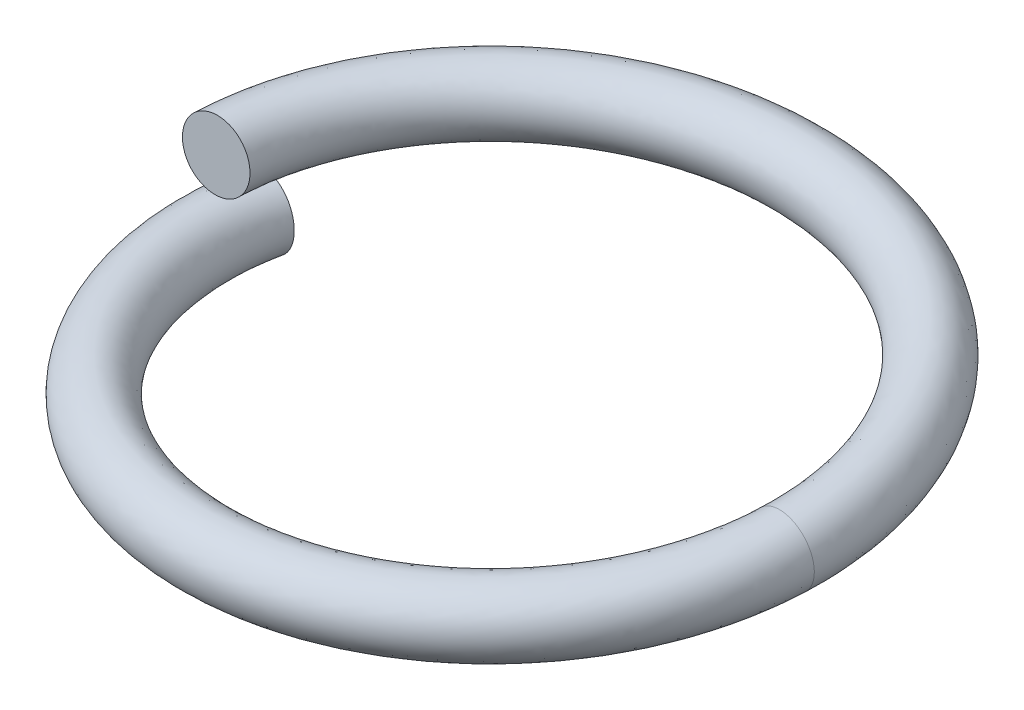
ISO-10303-21;
HEADER;
FILE_DESCRIPTION(('STEP AP214'),'2;1');
FILE_NAME('part.step','',(''),(''),'','','');
FILE_SCHEMA(('AUTOMOTIVE_DESIGN { 1 0 10303 214 1 1 1 1 }'));
ENDSEC;
DATA;
#1=APPLICATION_CONTEXT('core data for automotive mechanical design processes');
#2=APPLICATION_PROTOCOL_DEFINITION('international standard','automotive_design',2000,#1);
#3=PRODUCT_CONTEXT('',#1,'mechanical');
#4=PRODUCT('Part','Part','',(#3));
#5=PRODUCT_RELATED_PRODUCT_CATEGORY('part','',(#4));
#6=PRODUCT_DEFINITION_FORMATION('','',#4);
#7=PRODUCT_DEFINITION_CONTEXT('part definition',#1,'design');
#8=PRODUCT_DEFINITION('design','',#6,#7);
#9=PRODUCT_DEFINITION_SHAPE('','',#8);
#10=(LENGTH_UNIT() NAMED_UNIT(*) SI_UNIT(.MILLI.,.METRE.));
#11=(NAMED_UNIT(*) PLANE_ANGLE_UNIT() SI_UNIT($,.RADIAN.));
#12=(NAMED_UNIT(*) SI_UNIT($,.STERADIAN.) SOLID_ANGLE_UNIT());
#13=UNCERTAINTY_MEASURE_WITH_UNIT(LENGTH_MEASURE(1.E-05),#10,'distance_accuracy_value','');
#14=(GEOMETRIC_REPRESENTATION_CONTEXT(3) GLOBAL_UNCERTAINTY_ASSIGNED_CONTEXT((#13)) GLOBAL_UNIT_ASSIGNED_CONTEXT((#10,
#11,#12)) REPRESENTATION_CONTEXT('',''));
#15=CARTESIAN_POINT('',(0.,0.,0.));
#16=DIRECTION('',(0.,0.,1.));
#17=DIRECTION('',(1.,0.,0.));
#18=AXIS2_PLACEMENT_3D('',#15,#16,#17);
#19=CARTESIAN_POINT('',(-4.38,0.499670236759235,-0.0181563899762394));
#20=CARTESIAN_POINT('',(-4.37756391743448,0.478316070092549,-0.605830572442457));
#21=CARTESIAN_POINT('',(-4.25528345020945,0.4569619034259,-1.19275281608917));
#22=CARTESIAN_POINT('',(-3.79037558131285,0.414253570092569,-2.27225647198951));
#23=CARTESIAN_POINT('',(-3.44795000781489,0.392899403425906,-2.76436923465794));
#24=CARTESIAN_POINT('',(-2.59731909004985,0.350191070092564,-3.5754762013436));
#25=CARTESIAN_POINT('',(-2.08948302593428,0.328836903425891,-3.89411828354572));
#26=CARTESIAN_POINT('',(-0.989097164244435,0.286128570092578,-4.30717811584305));
#27=CARTESIAN_POINT('',(-0.397025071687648,0.264774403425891,-4.40141654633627));
#28=CARTESIAN_POINT('',(0.777225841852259,0.222066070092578,-4.35040417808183));
#29=CARTESIAN_POINT('',(1.35889489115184,0.200711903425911,-4.20517552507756));
#30=CARTESIAN_POINT('',(2.41931409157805,0.158003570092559,-3.69824496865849));
#31=CARTESIAN_POINT('',(2.89760388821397,0.136649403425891,-3.3367631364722));
#32=CARTESIAN_POINT('',(3.67468990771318,0.0939410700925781,-2.45494411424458));
#33=CARTESIAN_POINT('',(3.97314877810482,0.072586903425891,-1.93498974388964));
#34=CARTESIAN_POINT('',(4.34268921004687,0.0298785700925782,-0.819235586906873));
#35=CARTESIAN_POINT('',(4.41361034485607,0.00852440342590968,-0.223920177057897));
#36=CARTESIAN_POINT('',(4.3649560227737,-0.0128813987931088,0.363167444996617));
#37=CARTESIAN_POINT('',(4.36483795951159,-0.0129330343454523,0.364583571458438));
#38=CARTESIAN_POINT('',(4.36471919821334,-0.0129846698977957,0.365999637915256));
#39=CARTESIAN_POINT('',(-3.38,0.499670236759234,-0.0181563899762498));
#40=CARTESIAN_POINT('',(-3.37756391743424,0.478316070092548,-0.471658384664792));
#41=CARTESIAN_POINT('',(-3.28264542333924,0.4569619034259,-0.924466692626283));
#42=CARTESIAN_POINT('',(-2.92285743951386,0.414253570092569,-1.75707257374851));
#43=CARTESIAN_POINT('',(-2.65814414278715,0.392899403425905,-2.13650868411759));
#44=CARTESIAN_POINT('',(-2.0009502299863,0.350191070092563,-2.76162955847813));
#45=CARTESIAN_POINT('',(-1.60875491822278,0.328836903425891,-3.00704294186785));
#46=CARTESIAN_POINT('',(-0.759203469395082,0.286128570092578,-3.32475709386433));
#47=CARTESIAN_POINT('',(-0.302216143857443,0.264774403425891,-3.3969199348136));
#48=CARTESIAN_POINT('',(0.603897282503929,0.222066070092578,-3.35644271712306));
#49=CARTESIAN_POINT('',(1.0526300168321,0.20071190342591,-3.24382023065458));
#50=CARTESIAN_POINT('',(1.87046877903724,0.158003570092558,-2.85162167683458));
#51=CARTESIAN_POINT('',(2.23921976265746,0.136649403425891,-2.57221587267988));
#52=CARTESIAN_POINT('',(2.8380573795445,0.0939410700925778,-1.89098650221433));
#53=CARTESIAN_POINT('',(3.06788404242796,0.0725869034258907,-1.48945867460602));
#54=CARTESIAN_POINT('',(3.35200001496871,0.0298785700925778,-0.628088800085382));
#55=CARTESIAN_POINT('',(3.40616598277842,0.00852440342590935,-0.168620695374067));
#56=CARTESIAN_POINT('',(3.36806414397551,-0.0128813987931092,0.284384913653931));
#57=CARTESIAN_POINT('',(3.36797169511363,-0.0129330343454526,0.285477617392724));
#58=CARTESIAN_POINT('',(3.36787870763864,-0.012984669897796,0.286570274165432));
#59=CARTESIAN_POINT('',(-3.38,-0.499670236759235,0.0181563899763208));
#60=CARTESIAN_POINT('',(-3.38243608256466,-0.521024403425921,-0.435345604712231));
#61=CARTESIAN_POINT('',(-3.29238763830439,-0.542378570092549,-0.889147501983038));
#62=CARTESIAN_POINT('',(-2.94156519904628,-0.58508690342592,-1.7255705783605));
#63=CARTESIAN_POINT('',(-2.68094350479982,-0.606441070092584,-2.10782863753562));
#64=CARTESIAN_POINT('',(-2.03050326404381,-0.649149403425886,-2.73997374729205));
#65=CARTESIAN_POINT('',(-1.64096708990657,-0.670503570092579,-2.98958636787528));
#66=CARTESIAN_POINT('',(-0.794877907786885,-0.713211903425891,-3.31640901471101));
#67=CARTESIAN_POINT('',(-0.338692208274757,-0.734566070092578,-3.39347715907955));
#68=CARTESIAN_POINT('',(0.567803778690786,-0.777274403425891,-3.36273675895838));
#69=CARTESIAN_POINT('',(1.01772053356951,-0.798628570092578,-3.25494155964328));
#70=CARTESIAN_POINT('',(1.83972553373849,-0.841336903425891,-2.87155177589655));
#71=CARTESIAN_POINT('',(2.21145692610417,-0.862691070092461,-2.59612363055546));
#72=CARTESIAN_POINT('',(2.81757851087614,-0.905399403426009,-1.92136695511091));
#73=CARTESIAN_POINT('',(3.051705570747,-0.926753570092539,-1.52233135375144));
#74=CARTESIAN_POINT('',(3.34505894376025,-0.969461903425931,-0.664063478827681));
#75=CARTESIAN_POINT('',(3.40415790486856,-0.99081607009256,-0.205203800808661));
#76=CARTESIAN_POINT('',(3.37092495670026,-1.01222187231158,0.248184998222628));
#77=CARTESIAN_POINT('',(3.37084425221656,-1.01227350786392,0.2492786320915));
#78=CARTESIAN_POINT('',(3.37076300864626,-1.01232514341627,0.25037222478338));
#79=CARTESIAN_POINT('',(-4.38,-0.499670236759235,0.0181563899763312));
#80=CARTESIAN_POINT('',(-4.38243608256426,-0.521024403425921,-0.569517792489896));
#81=CARTESIAN_POINT('',(-4.26502566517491,-0.542378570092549,-1.15743362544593));
#82=CARTESIAN_POINT('',(-3.80908334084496,-0.58508690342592,-2.24075447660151));
#83=CARTESIAN_POINT('',(-3.47074936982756,-0.606441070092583,-2.73568918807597));
#84=CARTESIAN_POINT('',(-2.62687212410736,-0.649149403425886,-3.55382039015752));
#85=CARTESIAN_POINT('',(-2.12169519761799,-0.670503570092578,-3.8766617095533));
#86=CARTESIAN_POINT('',(-1.02477160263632,-0.713211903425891,-4.29883003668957));
#87=CARTESIAN_POINT('',(-0.433501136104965,-0.734566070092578,-4.3979737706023));
#88=CARTESIAN_POINT('',(0.741132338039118,-0.777274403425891,-4.35669821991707));
#89=CARTESIAN_POINT('',(1.32398540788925,-0.798628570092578,-4.21629685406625));
#90=CARTESIAN_POINT('',(2.38857084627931,-0.841336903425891,-3.71817506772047));
#91=CARTESIAN_POINT('',(2.8698410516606,-0.86269107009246,-3.36067089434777));
#92=CARTESIAN_POINT('',(3.65421103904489,-0.905399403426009,-2.48532456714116));
#93=CARTESIAN_POINT('',(3.95697030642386,-0.926753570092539,-1.96786242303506));
#94=CARTESIAN_POINT('',(4.33574813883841,-0.96946190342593,-0.855210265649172));
#95=CARTESIAN_POINT('',(4.41160226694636,-0.99081607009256,-0.260503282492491));
#96=CARTESIAN_POINT('',(4.36781683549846,-1.01222187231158,0.326967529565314));
#97=CARTESIAN_POINT('',(4.36771051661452,-1.01227350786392,0.328384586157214));
#98=CARTESIAN_POINT('',(4.36760349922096,-1.01232514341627,0.329801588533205));
#99=CARTESIAN_POINT('',(-5.38,-0.499670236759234,0.0181563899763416));
#100=CARTESIAN_POINT('',(-5.38243608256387,-0.52102440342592,-0.703689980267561));
#101=CARTESIAN_POINT('',(-5.23766369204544,-0.542378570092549,-1.42571974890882));
#102=CARTESIAN_POINT('',(-4.67660148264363,-0.58508690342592,-2.75593837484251));
#103=CARTESIAN_POINT('',(-4.2605552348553,-0.606441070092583,-3.36354973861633));
#104=CARTESIAN_POINT('',(-3.2232409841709,-0.649149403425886,-4.36766703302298));
#105=CARTESIAN_POINT('',(-2.6024233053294,-0.670503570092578,-4.76373705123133));
#106=CARTESIAN_POINT('',(-1.25466529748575,-0.713211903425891,-5.28125105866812));
#107=CARTESIAN_POINT('',(-0.528310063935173,-0.734566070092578,-5.40247038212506));
#108=CARTESIAN_POINT('',(0.91446089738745,-0.777274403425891,-5.35065968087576));
#109=CARTESIAN_POINT('',(1.63025028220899,-0.798628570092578,-5.17765214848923));
#110=CARTESIAN_POINT('',(2.93741615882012,-0.841336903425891,-4.56479835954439));
#111=CARTESIAN_POINT('',(3.52822517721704,-0.86269107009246,-4.12521815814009));
#112=CARTESIAN_POINT('',(4.49084356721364,-0.905399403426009,-3.04928217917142));
#113=CARTESIAN_POINT('',(4.86223504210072,-0.926753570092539,-2.41339349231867));
#114=CARTESIAN_POINT('',(5.32643733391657,-0.96946190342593,-1.04635705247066));
#115=CARTESIAN_POINT('',(5.41904662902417,-0.990816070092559,-0.315802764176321));
#116=CARTESIAN_POINT('',(5.36470871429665,-1.01222187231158,0.405750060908));
#117=CARTESIAN_POINT('',(5.36457678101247,-1.01227350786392,0.407490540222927));
#118=CARTESIAN_POINT('',(5.36444398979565,-1.01232514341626,0.409230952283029));
#119=CARTESIAN_POINT('',(-5.38,0.499670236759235,-0.0181563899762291));
#120=CARTESIAN_POINT('',(-5.37756391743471,0.478316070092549,-0.740002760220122));
#121=CARTESIAN_POINT('',(-5.22792147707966,0.456961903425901,-1.46103893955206));
#122=CARTESIAN_POINT('',(-4.65789372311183,0.414253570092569,-2.78744037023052));
#123=CARTESIAN_POINT('',(-4.23775587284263,0.392899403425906,-3.3922297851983));
#124=CARTESIAN_POINT('',(-3.19368795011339,0.350191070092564,-4.38932284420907));
#125=CARTESIAN_POINT('',(-2.57021113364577,0.328836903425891,-4.78119362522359));
#126=CARTESIAN_POINT('',(-1.21899085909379,0.286128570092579,-5.28959913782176));
#127=CARTESIAN_POINT('',(-0.491833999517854,0.264774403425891,-5.40591315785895));
#128=CARTESIAN_POINT('',(0.950554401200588,0.222066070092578,-5.3443656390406));
#129=CARTESIAN_POINT('',(1.66515976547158,0.200711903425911,-5.16653081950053));
#130=CARTESIAN_POINT('',(2.96815940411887,0.158003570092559,-4.54486826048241));
#131=CARTESIAN_POINT('',(3.55598801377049,0.136649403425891,-4.10131040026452));
#132=CARTESIAN_POINT('',(4.51132243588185,0.0939410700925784,-3.01890172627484));
#133=CARTESIAN_POINT('',(4.87841351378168,0.0725869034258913,-2.38052081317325));
#134=CARTESIAN_POINT('',(5.33337840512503,0.0298785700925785,-1.01038237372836));
#135=CARTESIAN_POINT('',(5.42105470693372,0.00852440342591,-0.279219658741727));
#136=CARTESIAN_POINT('',(5.3618479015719,-0.0128813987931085,0.441949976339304));
#137=CARTESIAN_POINT('',(5.36170422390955,-0.012933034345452,0.443689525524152));
#138=CARTESIAN_POINT('',(5.36155968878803,-0.0129846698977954,0.445429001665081));
#139=CARTESIAN_POINT('',(-4.38,0.499670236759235,-0.0181563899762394));
#140=CARTESIAN_POINT('',(-4.37756391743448,0.478316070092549,-0.605830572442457));
#141=CARTESIAN_POINT('',(-4.25528345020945,0.4569619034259,-1.19275281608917));
#142=CARTESIAN_POINT('',(-3.79037558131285,0.414253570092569,-2.27225647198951));
#143=CARTESIAN_POINT('',(-3.44795000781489,0.392899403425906,-2.76436923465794));
#144=CARTESIAN_POINT('',(-2.59731909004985,0.350191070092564,-3.5754762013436));
#145=CARTESIAN_POINT('',(-2.08948302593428,0.328836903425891,-3.89411828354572));
#146=CARTESIAN_POINT('',(-0.989097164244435,0.286128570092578,-4.30717811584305));
#147=CARTESIAN_POINT('',(-0.397025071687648,0.264774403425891,-4.40141654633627));
#148=CARTESIAN_POINT('',(0.777225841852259,0.222066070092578,-4.35040417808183));
#149=CARTESIAN_POINT('',(1.35889489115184,0.200711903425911,-4.20517552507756));
#150=CARTESIAN_POINT('',(2.41931409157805,0.158003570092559,-3.69824496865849));
#151=CARTESIAN_POINT('',(2.89760388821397,0.136649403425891,-3.3367631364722));
#152=CARTESIAN_POINT('',(3.67468990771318,0.0939410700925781,-2.45494411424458));
#153=CARTESIAN_POINT('',(3.97314877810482,0.072586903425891,-1.93498974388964));
#154=CARTESIAN_POINT('',(4.34268921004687,0.0298785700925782,-0.819235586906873));
#155=CARTESIAN_POINT('',(4.41361034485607,0.00852440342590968,-0.223920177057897));
#156=CARTESIAN_POINT('',(4.3649560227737,-0.0128813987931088,0.363167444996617));
#157=CARTESIAN_POINT('',(4.36483795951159,-0.0129330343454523,0.364583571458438));
#158=CARTESIAN_POINT('',(4.36471919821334,-0.0129846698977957,0.365999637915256));
#159=(BOUNDED_SURFACE() B_SPLINE_SURFACE(3,3,((#19,#20,#21,#22,#23,#24,#25,#26,#27,#28,#29,#30,
#31,#32,#33,#34,#35,#36,#37,#38),(#39,#40,#41,#42,#43,#44,#45,#46,#47,#48,#49,#50,#51,#52,#53,
#54,#55,#56,#57,#58),(#59,#60,#61,#62,#63,#64,#65,#66,#67,#68,#69,#70,#71,#72,#73,#74,#75,#76,
#77,#78),(#79,#80,#81,#82,#83,#84,#85,#86,#87,#88,#89,#90,#91,#92,#93,#94,#95,#96,#97,#98),(#99,
#100,#101,#102,#103,#104,#105,#106,#107,#108,#109,#110,#111,#112,#113,#114,#115,#116,#117,#118),
(#119,#120,#121,#122,#123,#124,#125,#126,#127,#128,#129,#130,#131,#132,#133,#134,#135,#136,#137,
#138),(#139,#140,#141,#142,#143,#144,#145,#146,#147,#148,#149,#150,#151,#152,#153,#154,#155,
#156,#157,#158)),.UNSPECIFIED.,.T.,.F.,.F.) B_SPLINE_SURFACE_WITH_KNOTS((4,3,4),(4,2,2,2,2,2,2,
2,2,4),(0.,0.5,1.),(0.,0.0625,0.125,0.1875,0.25,0.3125,0.375,0.4375,0.5,0.500151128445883),
.UNSPECIFIED.) GEOMETRIC_REPRESENTATION_ITEM() RATIONAL_B_SPLINE_SURFACE(((1.,1.,1.,1.,1.,1.,1.,
1.,1.,1.,1.,1.,1.,1.,1.,1.,1.,1.,1.,1.),(0.333333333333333,0.333333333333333,0.333333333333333,
0.333333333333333,0.333333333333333,0.333333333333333,0.333333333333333,0.333333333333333,
0.333333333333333,0.333333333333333,0.333333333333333,0.333333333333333,0.333333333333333,
0.333333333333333,0.333333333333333,0.333333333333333,0.333333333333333,0.333333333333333,
0.333333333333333,0.333333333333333),(0.333333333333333,0.333333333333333,0.333333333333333,
0.333333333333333,0.333333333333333,0.333333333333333,0.333333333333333,0.333333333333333,
0.333333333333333,0.333333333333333,0.333333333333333,0.333333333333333,0.333333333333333,
0.333333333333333,0.333333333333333,0.333333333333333,0.333333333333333,0.333333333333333,
0.333333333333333,0.333333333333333),(1.,1.,1.,1.,1.,1.,1.,1.,1.,1.,1.,1.,1.,1.,1.,1.,1.,1.,1.,
1.),(0.333333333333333,0.333333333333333,0.333333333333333,0.333333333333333,0.333333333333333,
0.333333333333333,0.333333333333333,0.333333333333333,0.333333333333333,0.333333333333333,
0.333333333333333,0.333333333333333,0.333333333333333,0.333333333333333,0.333333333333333,
0.333333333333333,0.333333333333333,0.333333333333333,0.333333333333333,0.333333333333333),
(0.333333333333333,0.333333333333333,0.333333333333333,0.333333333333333,0.333333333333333,
0.333333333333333,0.333333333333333,0.333333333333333,0.333333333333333,0.333333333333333,
0.333333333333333,0.333333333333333,0.333333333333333,0.333333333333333,0.333333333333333,
0.333333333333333,0.333333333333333,0.333333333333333,0.333333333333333,0.333333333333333),(1.,
1.,1.,1.,1.,1.,1.,1.,1.,1.,1.,1.,1.,1.,1.,1.,1.,1.,1.,1.))) REPRESENTATION_ITEM('') SURFACE());
#160=CARTESIAN_POINT('',(-4.38,0.,0.));
#161=DIRECTION('',(0.,-0.0363127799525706,-0.999340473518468));
#162=DIRECTION('',(0.,0.999340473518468,-0.0363127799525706));
#163=AXIS2_PLACEMENT_3D('',#160,#161,#162);
#164=CIRCLE('',#163,0.5);
#165=CARTESIAN_POINT('',(-4.38,0.499670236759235,-0.0181563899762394));
#166=VERTEX_POINT('',#165);
#167=EDGE_CURVE('E48',#166,#166,#164,.T.);
#168=CARTESIAN_POINT('',(4.36616134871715,-0.51265490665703,0.34790061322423));
#169=DIRECTION('',(-0.0793769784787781,-0.0363127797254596,0.99618305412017));
#170=DIRECTION('',(-0.00288430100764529,0.999340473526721,0.0361980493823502));
#171=AXIS2_PLACEMENT_3D('',#168,#169,#170);
#172=CIRCLE('',#171,0.499999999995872);
#173=CARTESIAN_POINT('',(4.36471919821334,-0.0129846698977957,0.365999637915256));
#174=VERTEX_POINT('',#173);
#175=EDGE_CURVE('E11',#174,#174,#172,.T.);
#176=CARTESIAN_POINT('',(-4.38,0.499670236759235,-0.0181563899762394));
#177=CARTESIAN_POINT('',(-4.37939084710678,0.494329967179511,-0.165121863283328));
#178=CARTESIAN_POINT('',(-4.3712866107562,0.488989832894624,-0.312037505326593));
#179=CARTESIAN_POINT('',(-4.34039141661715,0.478309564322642,-0.604322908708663));
#180=CARTESIAN_POINT('',(-4.31760006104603,0.472969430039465,-0.749692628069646));
#181=CARTESIAN_POINT('',(-4.25763414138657,0.462289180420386,-1.03743184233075));
#182=CARTESIAN_POINT('',(-4.22045957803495,0.456949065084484,-1.17980133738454));
#183=CARTESIAN_POINT('',(-4.13202382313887,0.446268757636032,-1.46010036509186));
#184=CARTESIAN_POINT('',(-4.08076301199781,0.44092856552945,-1.59803001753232));
#185=CARTESIAN_POINT('',(-3.96447439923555,0.430248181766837,-1.86795809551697));
#186=CARTESIAN_POINT('',(-3.89944659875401,0.424907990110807,-1.99995652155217));
#187=CARTESIAN_POINT('',(-3.75648867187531,0.414227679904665,-2.25676711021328));
#188=CARTESIAN_POINT('',(-3.67855819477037,0.408887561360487,-2.38157907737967));
#189=CARTESIAN_POINT('',(-3.51063881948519,0.398207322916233,-2.62280917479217));
#190=CARTESIAN_POINT('',(-3.42064992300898,0.392867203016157,-2.73922730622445));
#191=CARTESIAN_POINT('',(-3.22945185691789,0.382186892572,-2.96245803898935));
#192=CARTESIAN_POINT('',(-3.12824298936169,0.376846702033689,-3.06927089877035));
#193=CARTESIAN_POINT('',(-2.91548329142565,0.366166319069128,-3.27204530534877));
#194=CARTESIAN_POINT('',(-2.80393246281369,0.36082612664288,-3.36800685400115));
#195=CARTESIAN_POINT('',(-2.57177636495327,0.350145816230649,-3.54826280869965));
#196=CARTESIAN_POINT('',(-2.4511708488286,0.344805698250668,-3.63255689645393));
#197=CARTESIAN_POINT('',(-2.20215478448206,0.334125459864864,-3.78869744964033));
#198=CARTESIAN_POINT('',(-2.07374423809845,0.32878533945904,-3.86054391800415));
#199=CARTESIAN_POINT('',(-1.81036391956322,0.318105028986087,-3.99100260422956));
#200=CARTESIAN_POINT('',(-1.67539432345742,0.312764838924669,-4.04961517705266));
#201=CARTESIAN_POINT('',(-1.40019230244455,0.302084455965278,-4.1528043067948));
#202=CARTESIAN_POINT('',(-1.25995987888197,0.296744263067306,-4.19738086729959));
#203=CARTESIAN_POINT('',(-0.975736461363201,0.286063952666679,-4.27225217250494));
#204=CARTESIAN_POINT('',(-0.831745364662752,0.280723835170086,-4.30254652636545));
#205=CARTESIAN_POINT('',(-0.541459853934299,0.270043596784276,-4.34862466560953));
#206=CARTESIAN_POINT('',(-0.395165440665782,0.26470347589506,-4.36440845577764));
#207=CARTESIAN_POINT('',(-0.101727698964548,0.25402316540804,-4.38122963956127));
#208=CARTESIAN_POINT('',(0.045415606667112,0.24868297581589,-4.38226742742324));
#209=CARTESIAN_POINT('',(0.339044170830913,0.238002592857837,-4.36936722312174));
#210=CARTESIAN_POINT('',(0.485529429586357,0.232662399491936,-4.35542923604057));
#211=CARTESIAN_POINT('',(0.776361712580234,0.221982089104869,-4.31294103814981));
#212=CARTESIAN_POINT('',(0.920708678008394,0.216641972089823,-4.28439042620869));
#213=CARTESIAN_POINT('',(1.20583582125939,0.205961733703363,-4.21303648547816));
#214=CARTESIAN_POINT('',(1.34661600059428,0.200621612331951,-4.17023316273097));
#215=CARTESIAN_POINT('',(1.6231789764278,0.189941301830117,-4.07072647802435));
#216=CARTESIAN_POINT('',(1.75896190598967,0.184601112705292,-4.01402348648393));
#217=CARTESIAN_POINT('',(2.02405409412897,0.173920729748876,-3.88709720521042));
#218=CARTESIAN_POINT('',(2.15336335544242,0.168580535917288,-3.81687392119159));
#219=CARTESIAN_POINT('',(2.40428903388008,0.157900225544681,-3.66382174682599));
#220=CARTESIAN_POINT('',(2.52590523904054,0.152560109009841,-3.58099250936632));
#221=CARTESIAN_POINT('',(2.76027122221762,0.141879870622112,-3.40361872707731));
#222=CARTESIAN_POINT('',(2.87302100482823,0.136539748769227,-3.30907418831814));
#223=CARTESIAN_POINT('',(3.08847596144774,0.125859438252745,-3.10915465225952));
#224=CARTESIAN_POINT('',(3.1911814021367,0.120519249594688,-3.00377994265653));
#225=CARTESIAN_POINT('',(3.38533839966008,0.109838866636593,-2.78312815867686));
#226=CARTESIAN_POINT('',(3.47678996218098,0.104498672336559,-2.66785108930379));
#227=CARTESIAN_POINT('',(3.6476761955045,0.0938183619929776,-2.4287139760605));
#228=CARTESIAN_POINT('',(3.72711053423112,0.0884782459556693,-2.30485369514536));
#229=CARTESIAN_POINT('',(3.87323122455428,0.0777980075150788,-2.04982895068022));
#230=CARTESIAN_POINT('',(3.93991758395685,0.0724578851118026,-1.9186644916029));
#231=CARTESIAN_POINT('',(4.0598048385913,0.0617775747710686,-1.65030709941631));
#232=CARTESIAN_POINT('',(4.11300609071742,0.0564373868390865,-1.51311432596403));
#233=CARTESIAN_POINT('',(4.20517443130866,0.0457570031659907,-1.23402795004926));
#234=CARTESIAN_POINT('',(4.2441415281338,0.0404168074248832,-1.09213435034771));
#235=CARTESIAN_POINT('',(4.30765698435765,0.0297364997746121,-0.80516009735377));
#236=CARTESIAN_POINT('',(4.33220494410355,0.024396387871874,-0.660079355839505));
#237=CARTESIAN_POINT('',(4.36670977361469,0.0137161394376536,-0.368190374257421));
#238=CARTESIAN_POINT('',(4.37666665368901,0.00837600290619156,-0.22138213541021));
#239=CARTESIAN_POINT('',(4.38181247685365,-0.00230427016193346,0.0724865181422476));
#240=CARTESIAN_POINT('',(4.37700180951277,-0.00764440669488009,0.219546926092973));
#241=CARTESIAN_POINT('',(4.36471919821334,-0.0129846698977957,0.365999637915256));
#242=B_SPLINE_CURVE_WITH_KNOTS('',3,(#176,#177,#178,#179,#180,#181,#182,#183,#184,#185,#186,
#187,#188,#189,#190,#191,#192,#193,#194,#195,#196,#197,#198,#199,#200,#201,#202,#203,#204,#205,
#206,#207,#208,#209,#210,#211,#212,#213,#214,#215,#216,#217,#218,#219,#220,#221,#222,#223,#224,
#225,#226,#227,#228,#229,#230,#231,#232,#233,#234,#235,#236,#237,#238,#239,#240,#241),
.UNSPECIFIED.,.F.,.F.,(4,2,2,2,2,2,2,2,2,2,2,2,2,2,2,2,2,2,2,2,2,2,2,2,2,2,2,2,2,2,2,2,4),(0.,
0.440975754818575,0.88196345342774,1.3229511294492,1.76392689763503,2.2049026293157,
2.64589034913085,3.08687800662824,3.5278537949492,3.9688295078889,4.40981724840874,
4.85080488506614,5.29178069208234,5.73275638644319,6.17374414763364,6.61473176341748,
7.05570758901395,7.49668326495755,7.9376710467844,8.37865864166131,8.81963448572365,
9.26061014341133,9.70159794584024,10.142585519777,10.5835613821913,11.024537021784,
11.4655248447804,11.9065123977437,12.3474882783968,12.7884639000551,13.2294517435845,
13.6704392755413,14.1114151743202),.UNSPECIFIED.);
#243=EDGE_CURVE('BSEAM36',#166,#174,#242,.T.);
#244=ORIENTED_EDGE('',*,*,#167,.T.);
#245=ORIENTED_EDGE('',*,*,#175,.F.);
#246=ORIENTED_EDGE('',*,*,#243,.T.);
#247=ORIENTED_EDGE('',*,*,#243,.F.);
#248=EDGE_LOOP('',(#244,#246,#245,#247));
#249=FACE_BOUND('',#248,.T.);
#250=ADVANCED_FACE('F36',(#249),#159,.T.);
#251=CARTESIAN_POINT('',(-4.38,0.,0.));
#252=DIRECTION('',(0.,-0.0363127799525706,-0.999340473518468));
#253=DIRECTION('',(0.,0.999340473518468,-0.0363127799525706));
#254=AXIS2_PLACEMENT_3D('',#251,#252,#253);
#255=PLANE('',#254);
#256=ORIENTED_EDGE('',*,*,#167,.F.);
#257=EDGE_LOOP('',(#256));
#258=FACE_BOUND('',#257,.T.);
#259=ADVANCED_FACE('F57',(#258),#255,.F.);
#260=CARTESIAN_POINT('',(-4.3260749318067,-1.025,-0.68518295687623));
#261=DIRECTION('',(0.156331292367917,-0.0363127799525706,-0.987036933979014));
#262=DIRECTION('',(0.00568057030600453,0.999340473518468,-0.0358657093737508));
#263=AXIS2_PLACEMENT_3D('',#260,#261,#262);
#264=PLANE('',#263);
#265=CARTESIAN_POINT('',(-4.3260749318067,-1.025,-0.68518295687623));
#266=DIRECTION('',(0.156331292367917,-0.0363127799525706,-0.987036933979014));
#267=DIRECTION('',(0.00568057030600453,0.999340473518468,-0.0358657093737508));
#268=AXIS2_PLACEMENT_3D('',#265,#266,#267);
#269=CIRCLE('',#268,0.5);
#270=CARTESIAN_POINT('',(-4.3232346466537,-0.525329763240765,-0.703115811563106));
#271=VERTEX_POINT('',#270);
#272=EDGE_CURVE('E44',#271,#271,#269,.T.);
#273=ORIENTED_EDGE('',*,*,#272,.T.);
#274=EDGE_LOOP('',(#273));
#275=FACE_BOUND('',#274,.T.);
#276=ADVANCED_FACE('F59',(#275),#264,.T.);
#277=CARTESIAN_POINT('',(4.36471919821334,-0.0129846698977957,0.365999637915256));
#278=CARTESIAN_POINT('',(4.31572357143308,-0.0342872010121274,0.950205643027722));
#279=CARTESIAN_POINT('',(4.14792076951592,-0.0555897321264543,1.52419867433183));
#280=CARTESIAN_POINT('',(3.60041193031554,-0.0982464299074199,2.56264130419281));
#281=CARTESIAN_POINT('',(3.22043121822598,-0.119600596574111,3.02637064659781));
#282=CARTESIAN_POINT('',(2.30878379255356,-0.16230892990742,3.76823750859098));
#283=CARTESIAN_POINT('',(1.77751284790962,-0.183663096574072,4.04605296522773));
#284=CARTESIAN_POINT('',(0.648110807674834,-0.226371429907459,4.37150419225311));
#285=CARTESIAN_POINT('',(0.0504700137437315,-0.247725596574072,4.41899867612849));
#286=CARTESIAN_POINT('',(-1.11615869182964,-0.290433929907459,4.27601289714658));
#287=CARTESIAN_POINT('',(-1.68464014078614,-0.311788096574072,4.08559470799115));
#288=CARTESIAN_POINT('',(-2.702017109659,-0.354496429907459,3.49702731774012));
#289=CARTESIAN_POINT('',(-3.15047096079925,-0.375850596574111,3.09913362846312));
#290=CARTESIAN_POINT('',(-3.85597476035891,-0.41855892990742,2.15906349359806));
#291=CARTESIAN_POINT('',(-4.11271843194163,-0.439913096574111,1.61729515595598));
#292=CARTESIAN_POINT('',(-4.39357863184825,-0.48262142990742,0.475986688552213));
#293=CARTESIAN_POINT('',(-4.41757323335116,-0.503975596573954,-0.123057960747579));
#294=CARTESIAN_POINT('',(-4.3232346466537,-0.525329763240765,-0.703115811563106));
#295=CARTESIAN_POINT('',(3.36787870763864,-0.012984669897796,0.286570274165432));
#296=CARTESIAN_POINT('',(3.32951621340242,-0.0342872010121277,0.737351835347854));
#297=CARTESIAN_POINT('',(3.1994806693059,-0.0555897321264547,1.18013967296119));
#298=CARTESIAN_POINT('',(2.77598892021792,-0.0982464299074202,1.98098085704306));
#299=CARTESIAN_POINT('',(2.48232143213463,-0.119600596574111,2.33847812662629));
#300=CARTESIAN_POINT('',(1.77810701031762,-0.16230892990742,2.91010912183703));
#301=CARTESIAN_POINT('',(1.36786579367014,-0.183663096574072,3.12399468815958));
#302=CARTESIAN_POINT('',(0.49600566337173,-0.226371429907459,3.37407439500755));
#303=CARTESIAN_POINT('',(0.0347652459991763,-0.247725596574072,3.41015996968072));
#304=CARTESIAN_POINT('',(-0.865379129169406,-0.29043392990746,3.2987146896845));
#305=CARTESIAN_POINT('',(-1.30389231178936,-0.311788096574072,3.15123221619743));
#306=CARTESIAN_POINT('',(-2.08843840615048,-0.35449642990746,2.69607578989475));
#307=CARTESIAN_POINT('',(-2.4341307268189,-0.375850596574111,2.38859943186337));
#308=CARTESIAN_POINT('',(-2.97767368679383,-0.41855892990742,1.66248580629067));
#309=CARTESIAN_POINT('',(-3.17528836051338,-0.439913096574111,1.24416376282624));
#310=CARTESIAN_POINT('',(-3.3909461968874,-0.48262142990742,0.363157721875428));
#311=CARTESIAN_POINT('',(-3.40889573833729,-0.503975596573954,-0.0991438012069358));
#312=CARTESIAN_POINT('',(-3.33554630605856,-0.525329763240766,-0.54668134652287));
#313=CARTESIAN_POINT('',(3.37076300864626,-1.01232514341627,0.25037222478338));
#314=CARTESIAN_POINT('',(3.33724552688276,-1.0336276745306,0.701539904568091));
#315=CARTESIAN_POINT('',(3.21197440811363,-1.054930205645,1.14569917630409));
#316=CARTESIAN_POINT('',(2.79711062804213,-1.09758690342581,1.95104376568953));
#317=CARTESIAN_POINT('',(2.50730072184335,-1.11894107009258,2.31167530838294));
#318=CARTESIAN_POINT('',(1.8092680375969,-1.16164940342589,2.89083877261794));
#319=CARTESIAN_POINT('',(1.40134829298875,-1.18300357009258,3.1091192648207));
#320=CARTESIAN_POINT('',(0.532225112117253,-1.22571190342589,3.36855103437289));
#321=CARTESIAN_POINT('',(0.0713989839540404,-1.2470660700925,3.40958968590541));
#322=CARTESIAN_POINT('',(-0.829890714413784,-1.28977440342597,3.30782119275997));
#323=CARTESIAN_POINT('',(-1.26996301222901,-1.3111285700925,3.16505822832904));
#324=CARTESIAN_POINT('',(-2.05935362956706,-1.35383690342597,2.718356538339));
#325=CARTESIAN_POINT('',(-2.4083292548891,-1.37519107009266,2.41461173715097));
#326=CARTESIAN_POINT('',(-2.95964157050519,-1.41789940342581,1.69437935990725));
#327=CARTESIAN_POINT('',(-3.16173892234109,-1.43925357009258,1.27820445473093));
#328=CARTESIAN_POINT('',(-3.38684906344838,-1.48196190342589,0.399566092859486));
#329=CARTESIAN_POINT('',(-3.40976412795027,-1.50331607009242,-0.0625159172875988));
#330=CARTESIAN_POINT('',(-3.34122687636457,-1.52467023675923,-0.510815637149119));
#331=CARTESIAN_POINT('',(4.36760349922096,-1.01232514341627,0.329801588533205));
#332=CARTESIAN_POINT('',(4.32345288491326,-1.0336276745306,0.91439371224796));
#333=CARTESIAN_POINT('',(4.16041450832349,-1.054930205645,1.48975817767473));
#334=CARTESIAN_POINT('',(3.62153363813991,-1.09758690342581,2.53270421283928));
#335=CARTESIAN_POINT('',(3.2454105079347,-1.11894107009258,2.99956782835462));
#336=CARTESIAN_POINT('',(2.33994481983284,-1.16164940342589,3.74896715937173));
#337=CARTESIAN_POINT('',(1.81099534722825,-1.18300357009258,4.03117754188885));
#338=CARTESIAN_POINT('',(0.684330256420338,-1.22571190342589,4.36598083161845));
#339=CARTESIAN_POINT('',(0.0871037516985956,-1.2470660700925,4.41842839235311));
#340=CARTESIAN_POINT('',(-1.08067027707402,-1.28977440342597,4.28511940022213));
#341=CARTESIAN_POINT('',(-1.65071084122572,-1.3111285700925,4.09942072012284));
#342=CARTESIAN_POINT('',(-2.67293233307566,-1.35383690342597,3.51930806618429));
#343=CARTESIAN_POINT('',(-3.12466948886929,-1.37519107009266,3.12514593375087));
#344=CARTESIAN_POINT('',(-3.83794264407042,-1.41789940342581,2.19095704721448));
#345=CARTESIAN_POINT('',(-4.09916899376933,-1.43925357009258,1.65133584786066));
#346=CARTESIAN_POINT('',(-4.38948149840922,-1.48196190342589,0.512395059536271));
#347=CARTESIAN_POINT('',(-4.41844162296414,-1.50331607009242,-0.086430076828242));
#348=CARTESIAN_POINT('',(-4.3289152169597,-1.52467023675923,-0.667250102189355));
#349=CARTESIAN_POINT('',(5.36444398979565,-1.01232514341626,0.409230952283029));
#350=CARTESIAN_POINT('',(5.30966024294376,-1.0336276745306,1.12724751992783));
#351=CARTESIAN_POINT('',(5.10885460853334,-1.054930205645,1.83381717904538));
#352=CARTESIAN_POINT('',(4.44595664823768,-1.09758690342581,3.11436465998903));
#353=CARTESIAN_POINT('',(3.98352029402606,-1.11894107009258,3.68746034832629));
#354=CARTESIAN_POINT('',(2.87062160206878,-1.16164940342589,4.60709554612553));
#355=CARTESIAN_POINT('',(2.22064240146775,-1.18300357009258,4.953235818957));
#356=CARTESIAN_POINT('',(0.836435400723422,-1.22571190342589,5.36341062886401));
#357=CARTESIAN_POINT('',(0.102808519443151,-1.2470660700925,5.4272670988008));
#358=CARTESIAN_POINT('',(-1.33144983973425,-1.28977440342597,5.26241760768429));
#359=CARTESIAN_POINT('',(-2.03145867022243,-1.3111285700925,5.03378321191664));
#360=CARTESIAN_POINT('',(-3.28651103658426,-1.35383690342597,4.32025959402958));
#361=CARTESIAN_POINT('',(-3.84100972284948,-1.37519107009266,3.83568013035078));
#362=CARTESIAN_POINT('',(-4.71624371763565,-1.41789940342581,2.68753473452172));
#363=CARTESIAN_POINT('',(-5.03659906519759,-1.43925357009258,2.0244672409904));
#364=CARTESIAN_POINT('',(-5.39211393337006,-1.48196190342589,0.625224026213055));
#365=CARTESIAN_POINT('',(-5.427119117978,-1.50331607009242,-0.110344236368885));
#366=CARTESIAN_POINT('',(-5.31660355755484,-1.52467023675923,-0.82368456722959));
#367=CARTESIAN_POINT('',(5.36155968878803,-0.0129846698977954,0.445429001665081));
#368=CARTESIAN_POINT('',(5.30193092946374,-0.034287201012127,1.16305945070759));
#369=CARTESIAN_POINT('',(5.09636086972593,-0.055589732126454,1.86825767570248));
#370=CARTESIAN_POINT('',(4.42483494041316,-0.0982464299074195,3.14430175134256));
#371=CARTESIAN_POINT('',(3.95854100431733,-0.119600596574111,3.71426316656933));
#372=CARTESIAN_POINT('',(2.8394605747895,-0.16230892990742,4.62636589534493));
#373=CARTESIAN_POINT('',(2.1871599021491,-0.183663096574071,4.96811124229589));
#374=CARTESIAN_POINT('',(0.800215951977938,-0.226371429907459,5.36893398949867));
#375=CARTESIAN_POINT('',(0.0661747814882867,-0.247725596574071,5.42783738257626));
#376=CARTESIAN_POINT('',(-1.36693825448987,-0.290433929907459,5.25331110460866));
#377=CARTESIAN_POINT('',(-2.06538796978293,-0.311788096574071,5.01995719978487));
#378=CARTESIAN_POINT('',(-3.31559581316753,-0.354496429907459,4.29797884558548));
#379=CARTESIAN_POINT('',(-3.8668111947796,-0.375850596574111,3.80966782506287));
#380=CARTESIAN_POINT('',(-4.73427583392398,-0.41855892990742,2.65564118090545));
#381=CARTESIAN_POINT('',(-5.05014850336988,-0.439913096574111,1.99042654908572));
#382=CARTESIAN_POINT('',(-5.39621106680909,-0.48262142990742,0.588815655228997));
#383=CARTESIAN_POINT('',(-5.42625072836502,-0.503975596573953,-0.146972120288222));
#384=CARTESIAN_POINT('',(-5.31092298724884,-0.525329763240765,-0.859550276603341));
#385=CARTESIAN_POINT('',(4.36471919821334,-0.0129846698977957,0.365999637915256));
#386=CARTESIAN_POINT('',(4.31572357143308,-0.0342872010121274,0.950205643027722));
#387=CARTESIAN_POINT('',(4.14792076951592,-0.0555897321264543,1.52419867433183));
#388=CARTESIAN_POINT('',(3.60041193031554,-0.0982464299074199,2.56264130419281));
#389=CARTESIAN_POINT('',(3.22043121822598,-0.119600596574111,3.02637064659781));
#390=CARTESIAN_POINT('',(2.30878379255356,-0.16230892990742,3.76823750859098));
#391=CARTESIAN_POINT('',(1.77751284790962,-0.183663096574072,4.04605296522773));
#392=CARTESIAN_POINT('',(0.648110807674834,-0.226371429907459,4.37150419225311));
#393=CARTESIAN_POINT('',(0.0504700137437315,-0.247725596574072,4.41899867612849));
#394=CARTESIAN_POINT('',(-1.11615869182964,-0.290433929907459,4.27601289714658));
#395=CARTESIAN_POINT('',(-1.68464014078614,-0.311788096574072,4.08559470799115));
#396=CARTESIAN_POINT('',(-2.702017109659,-0.354496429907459,3.49702731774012));
#397=CARTESIAN_POINT('',(-3.15047096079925,-0.375850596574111,3.09913362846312));
#398=CARTESIAN_POINT('',(-3.85597476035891,-0.41855892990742,2.15906349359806));
#399=CARTESIAN_POINT('',(-4.11271843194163,-0.439913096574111,1.61729515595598));
#400=CARTESIAN_POINT('',(-4.39357863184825,-0.48262142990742,0.475986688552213));
#401=CARTESIAN_POINT('',(-4.41757323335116,-0.503975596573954,-0.123057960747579));
#402=CARTESIAN_POINT('',(-4.3232346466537,-0.525329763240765,-0.703115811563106));
#403=(BOUNDED_SURFACE() B_SPLINE_SURFACE(3,3,((#277,#278,#279,#280,#281,#282,#283,#284,#285,
#286,#287,#288,#289,#290,#291,#292,#293,#294),(#295,#296,#297,#298,#299,#300,#301,#302,#303,
#304,#305,#306,#307,#308,#309,#310,#311,#312),(#313,#314,#315,#316,#317,#318,#319,#320,#321,
#322,#323,#324,#325,#326,#327,#328,#329,#330),(#331,#332,#333,#334,#335,#336,#337,#338,#339,
#340,#341,#342,#343,#344,#345,#346,#347,#348),(#349,#350,#351,#352,#353,#354,#355,#356,#357,
#358,#359,#360,#361,#362,#363,#364,#365,#366),(#367,#368,#369,#370,#371,#372,#373,#374,#375,
#376,#377,#378,#379,#380,#381,#382,#383,#384),(#385,#386,#387,#388,#389,#390,#391,#392,#393,
#394,#395,#396,#397,#398,#399,#400,#401,#402)),.UNSPECIFIED.,.T.,.F.,
.F.) B_SPLINE_SURFACE_WITH_KNOTS((4,3,4),(4,2,2,2,2,2,2,2,4),(0.,0.5,1.),(0.500151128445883,
0.5625,0.625,0.6875,0.75,0.8125,0.875,0.9375,1.),
.UNSPECIFIED.) GEOMETRIC_REPRESENTATION_ITEM() RATIONAL_B_SPLINE_SURFACE(((1.,1.,1.,1.,1.,1.,1.,
1.,1.,1.,1.,1.,1.,1.,1.,1.,1.,1.),(0.333333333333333,0.333333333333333,0.333333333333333,
0.333333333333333,0.333333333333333,0.333333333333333,0.333333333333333,0.333333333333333,
0.333333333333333,0.333333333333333,0.333333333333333,0.333333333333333,0.333333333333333,
0.333333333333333,0.333333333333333,0.333333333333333,0.333333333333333,0.333333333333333),
(0.333333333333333,0.333333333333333,0.333333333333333,0.333333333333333,0.333333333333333,
0.333333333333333,0.333333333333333,0.333333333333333,0.333333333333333,0.333333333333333,
0.333333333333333,0.333333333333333,0.333333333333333,0.333333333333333,0.333333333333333,
0.333333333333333,0.333333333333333,0.333333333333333),(1.,1.,1.,1.,1.,1.,1.,1.,1.,1.,1.,1.,1.,
1.,1.,1.,1.,1.),(0.333333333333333,0.333333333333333,0.333333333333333,0.333333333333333,
0.333333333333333,0.333333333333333,0.333333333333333,0.333333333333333,0.333333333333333,
0.333333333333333,0.333333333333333,0.333333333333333,0.333333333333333,0.333333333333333,
0.333333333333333,0.333333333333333,0.333333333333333,0.333333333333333),(0.333333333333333,
0.333333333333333,0.333333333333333,0.333333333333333,0.333333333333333,0.333333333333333,
0.333333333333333,0.333333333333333,0.333333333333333,0.333333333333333,0.333333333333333,
0.333333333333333,0.333333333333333,0.333333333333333,0.333333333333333,0.333333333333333,
0.333333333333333,0.333333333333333),(1.,1.,1.,1.,1.,1.,1.,1.,1.,1.,1.,1.,1.,1.,1.,1.,1.,1.))) REPRESENTATION_ITEM('') SURFACE());
#404=CARTESIAN_POINT('',(4.36471919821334,-0.0129846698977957,0.365999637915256));
#405=CARTESIAN_POINT('',(4.35244417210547,-0.0183217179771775,0.512363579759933));
#406=CARTESIAN_POINT('',(4.33271209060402,-0.0236586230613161,0.658083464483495));
#407=CARTESIAN_POINT('',(4.27874908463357,-0.0343324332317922,0.94682018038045));
#408=CARTESIAN_POINT('',(4.2445177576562,-0.0396693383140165,1.08983693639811));
#409=CARTESIAN_POINT('',(4.1619722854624,-0.0503431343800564,1.37174407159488));
#410=CARTESIAN_POINT('',(4.11365815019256,-0.0556800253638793,1.51063445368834));
#411=CARTESIAN_POINT('',(4.00335428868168,-0.0663538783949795,1.78287900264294));
#412=CARTESIAN_POINT('',(3.94136492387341,-0.0716908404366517,1.91623331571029));
#413=CARTESIAN_POINT('',(3.80414826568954,-0.0823647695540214,2.17594743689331));
#414=CARTESIAN_POINT('',(3.72892098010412,-0.087701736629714,2.30230724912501));
#415=CARTESIAN_POINT('',(3.56618924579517,-0.0983755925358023,2.54685304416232));
#416=CARTESIAN_POINT('',(3.47868445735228,-0.103712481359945,2.66503880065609));
#417=CARTESIAN_POINT('',(3.29233150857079,-0.114386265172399,2.89210062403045));
#418=CARTESIAN_POINT('',(3.19348335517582,-0.119723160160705,3.00097669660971));
#419=CARTESIAN_POINT('',(2.98537247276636,-0.130397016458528,3.20827872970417));
#420=CARTESIAN_POINT('',(2.87611001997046,-0.135733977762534,3.30670496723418));
#421=CARTESIAN_POINT('',(2.64814362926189,-0.146407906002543,3.49193752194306));
#422=CARTESIAN_POINT('',(2.52943969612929,-0.151744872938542,3.57874384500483));
#423=CARTESIAN_POINT('',(2.28393624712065,-0.162418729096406,3.74002724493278));
#424=CARTESIAN_POINT('',(2.15713650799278,-0.167755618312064,3.81450398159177));
#425=CARTESIAN_POINT('',(1.8967455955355,-0.178429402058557,3.95044905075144));
#426=CARTESIAN_POINT('',(1.76315442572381,-0.183766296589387,4.01191738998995));
#427=CARTESIAN_POINT('',(1.4904819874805,-0.194440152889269,4.12116030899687));
#428=CARTESIAN_POINT('',(1.35140086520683,-0.199777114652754,4.16893525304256));
#429=CARTESIAN_POINT('',(1.06910185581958,-0.210451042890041,4.25009585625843));
#430=CARTESIAN_POINT('',(0.925883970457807,-0.215788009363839,4.28348152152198));
#431=CARTESIAN_POINT('',(0.63682762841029,-0.22646186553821,4.3357377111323));
#432=CARTESIAN_POINT('',(0.490989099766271,-0.231798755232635,4.35460783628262));
#433=CARTESIAN_POINT('',(0.198157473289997,-0.242472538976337,4.37771903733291));
#434=CARTESIAN_POINT('',(0.0511643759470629,-0.247809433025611,4.38196011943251));
#435=CARTESIAN_POINT('',(-0.242510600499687,-0.258483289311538,4.37569252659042));
#436=CARTESIAN_POINT('',(-0.389192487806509,-0.263820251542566,4.36518424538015));
#437=CARTESIAN_POINT('',(-0.68072746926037,-0.274494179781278,4.32930766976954));
#438=CARTESIAN_POINT('',(-0.825580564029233,-0.279831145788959,4.30393938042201));
#439=CARTESIAN_POINT('',(-1.11201347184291,-0.290505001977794,4.23882051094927));
#440=CARTESIAN_POINT('',(-1.25359319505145,-0.295841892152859,4.19906953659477));
#441=CARTESIAN_POINT('',(-1.53208590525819,-0.306515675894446,4.10565487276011));
#442=CARTESIAN_POINT('',(-1.6689988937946,-0.311852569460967,4.05199118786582));
#443=CARTESIAN_POINT('',(-1.93676226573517,-0.322526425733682,3.93121432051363));
#444=CARTESIAN_POINT('',(-2.06761281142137,-0.327863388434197,3.86410149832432));
#445=CARTESIAN_POINT('',(-2.32181169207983,-0.338537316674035,3.71691894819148));
#446=CARTESIAN_POINT('',(-2.44516002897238,-0.343874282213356,3.63684922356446));
#447=CARTESIAN_POINT('',(-2.68321226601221,-0.354548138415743,3.46475793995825));
#448=CARTESIAN_POINT('',(-2.79791592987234,-0.359885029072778,3.37273605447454));
#449=CARTESIAN_POINT('',(-3.01758072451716,-0.370558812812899,3.1777184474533));
#450=CARTESIAN_POINT('',(-3.12254185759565,-0.375895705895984,3.07472272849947));
#451=CARTESIAN_POINT('',(-3.32161882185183,-0.386569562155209,2.85873051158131));
#452=CARTESIAN_POINT('',(-3.4157349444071,-0.391906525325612,2.74573428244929));
#453=CARTESIAN_POINT('',(-3.59199001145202,-0.402580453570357,2.51075784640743));
#454=CARTESIAN_POINT('',(-3.67412895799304,-0.407917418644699,2.38877764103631));
#455=CARTESIAN_POINT('',(-3.82577203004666,-0.418591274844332,2.13720527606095));
#456=CARTESIAN_POINT('',(-3.89527581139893,-0.423928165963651,2.00761290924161));
#457=CARTESIAN_POINT('',(-4.02102140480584,-0.434601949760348,1.74214626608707));
#458=CARTESIAN_POINT('',(-4.07726321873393,-0.439938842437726,1.60627199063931));
#459=CARTESIAN_POINT('',(-4.17585152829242,-0.45061269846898,1.32956889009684));
#460=CARTESIAN_POINT('',(-4.21819839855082,-0.45594966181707,1.18874019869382));
#461=CARTESIAN_POINT('',(-4.28835327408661,-0.466623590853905,0.903506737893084));
#462=CARTESIAN_POINT('',(-4.31616128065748,-0.47196055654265,0.759101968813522));
#463=CARTESIAN_POINT('',(-4.35717049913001,-0.482634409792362,0.468237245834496));
#464=CARTESIAN_POINT('',(-4.37037131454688,-0.487971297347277,0.321777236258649));
#465=CARTESIAN_POINT('',(-4.38210969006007,-0.49864509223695,0.0282681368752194));
#466=CARTESIAN_POINT('',(-4.38064725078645,-0.503981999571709,-0.118780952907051));
#467=CARTESIAN_POINT('',(-4.36299851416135,-0.514655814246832,-0.411986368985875));
#468=CARTESIAN_POINT('',(-4.34681261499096,-0.519992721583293,-0.558142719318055));
#469=CARTESIAN_POINT('',(-4.3232346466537,-0.525329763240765,-0.703115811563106));
#470=B_SPLINE_CURVE_WITH_KNOTS('',3,(#404,#405,#406,#407,#408,#409,#410,#411,#412,#413,#414,
#415,#416,#417,#418,#419,#420,#421,#422,#423,#424,#425,#426,#427,#428,#429,#430,#431,#432,#433,
#434,#435,#436,#437,#438,#439,#440,#441,#442,#443,#444,#445,#446,#447,#448,#449,#450,#451,#452,
#453,#454,#455,#456,#457,#458,#459,#460,#461,#462,#463,#464,#465,#466,#467,#468,#469),
.UNSPECIFIED.,.F.,.F.,(4,2,2,2,2,2,2,2,2,2,2,2,2,2,2,2,2,2,2,2,2,2,2,2,2,2,2,2,2,2,2,2,4),(0.,
0.44070933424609,0.881430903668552,1.32215216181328,1.76286177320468,2.20357112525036,
2.64429267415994,3.08501395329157,3.52572354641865,3.96643291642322,4.40715444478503,
4.8478757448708,5.28858531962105,5.72929470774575,6.17001621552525,6.61073753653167,
7.051447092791,7.49215649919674,7.93287798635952,8.37359932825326,8.81430886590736,
9.25501829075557,9.69573975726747,10.1364611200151,10.5771706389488,11.0178800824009,
11.4586015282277,11.8993229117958,12.340032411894,12.7807418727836,13.2214632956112,
13.6621846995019,14.1028941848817),.UNSPECIFIED.);
#471=EDGE_CURVE('BSEAM65',#174,#271,#470,.T.);
#472=ORIENTED_EDGE('',*,*,#175,.T.);
#473=ORIENTED_EDGE('',*,*,#272,.F.);
#474=ORIENTED_EDGE('',*,*,#471,.T.);
#475=ORIENTED_EDGE('',*,*,#471,.F.);
#476=EDGE_LOOP('',(#472,#474,#473,#475));
#477=FACE_BOUND('',#476,.T.);
#478=ADVANCED_FACE('F65',(#477),#403,.T.);
#479=CLOSED_SHELL('',(#250,#259,#276,#478));
#480=MANIFOLD_SOLID_BREP('B2',#479);
#481=ADVANCED_BREP_SHAPE_REPRESENTATION('',(#18,#480),#14);
#482=SHAPE_DEFINITION_REPRESENTATION(#9,#481);
ENDSEC;
END-ISO-10303-21;
